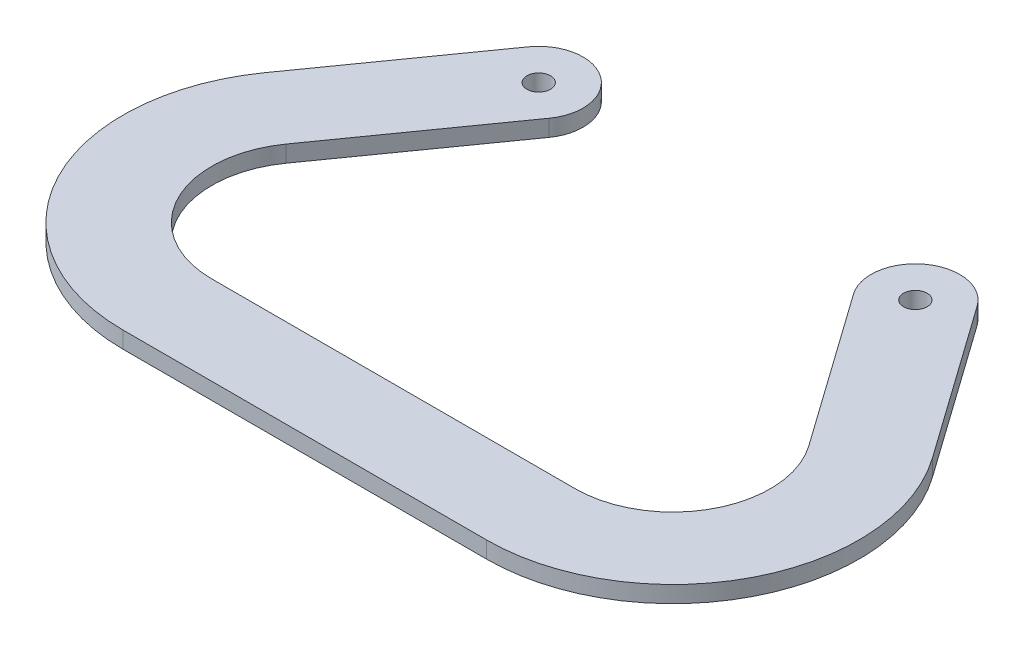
from build123d import *

# Parameters (mm, degrees)
BOSS_EXTRUDE1_DEPTH              = 4.7625
F_17_64_0_26563_DIAMETER_HOLE2_D = 6.747002


with BuildPart() as part:
    # Sketch1 → Boss-Extrude1 (new body)
    with BuildSketch(Plane(origin=(0, 0, 0), x_dir=(1, 0, 0), z_dir=(0, 1, 0))):
        with BuildLine():
            Line((-74.857680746, 16.166793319), (-43.587414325, 60.243366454))
            ThreePointArc((-43.587414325, 60.243366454), (-46.59690861, 77.949945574), (-64.30348773, 74.940451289))
            Line((-64.30348773, 74.940451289), (-95.573754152, 30.863878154))
            ThreePointArc((-95.573754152, 30.863878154), (-99.459001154, -24.483426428), (-52.07, -53.34))
            Line((-52.07, -53.34), (52.07, -53.34))
            ThreePointArc((52.07, -53.34), (99.459001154, -24.483426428), (95.573754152, 30.863878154))
            Line((95.573754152, 30.863878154), (64.30348773, 74.940451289))
            ThreePointArc((64.30348773, 74.940451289), (46.59690861, 77.949945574), (43.587414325, 60.243366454))
            Line((43.587414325, 60.243366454), (74.857680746, 16.166793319))
            ThreePointArc((74.857680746, 16.166793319), (76.892810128, -12.824651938), (52.07, -27.94))
            Line((52.07, -27.94), (-52.07, -27.94))
            ThreePointArc((-52.07, -27.94), (-76.892810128, -12.824651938), (-74.857680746, 16.166793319))
        make_face()
    extrude(amount=BOSS_EXTRUDE1_DEPTH)

    # 17_64 _0.26563_ Diameter Hole2 (through all)
    with Locations(Plane(origin=(0, 4.7625, 0), x_dir=(1, 0, 0), z_dir=(0, 1, 0))):
        with Locations((-53.945451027, 67.591908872), (53.945451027, 67.591908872)):
            Hole(F_17_64_0_26563_DIAMETER_HOLE2_D / 2)


solid = part.part
